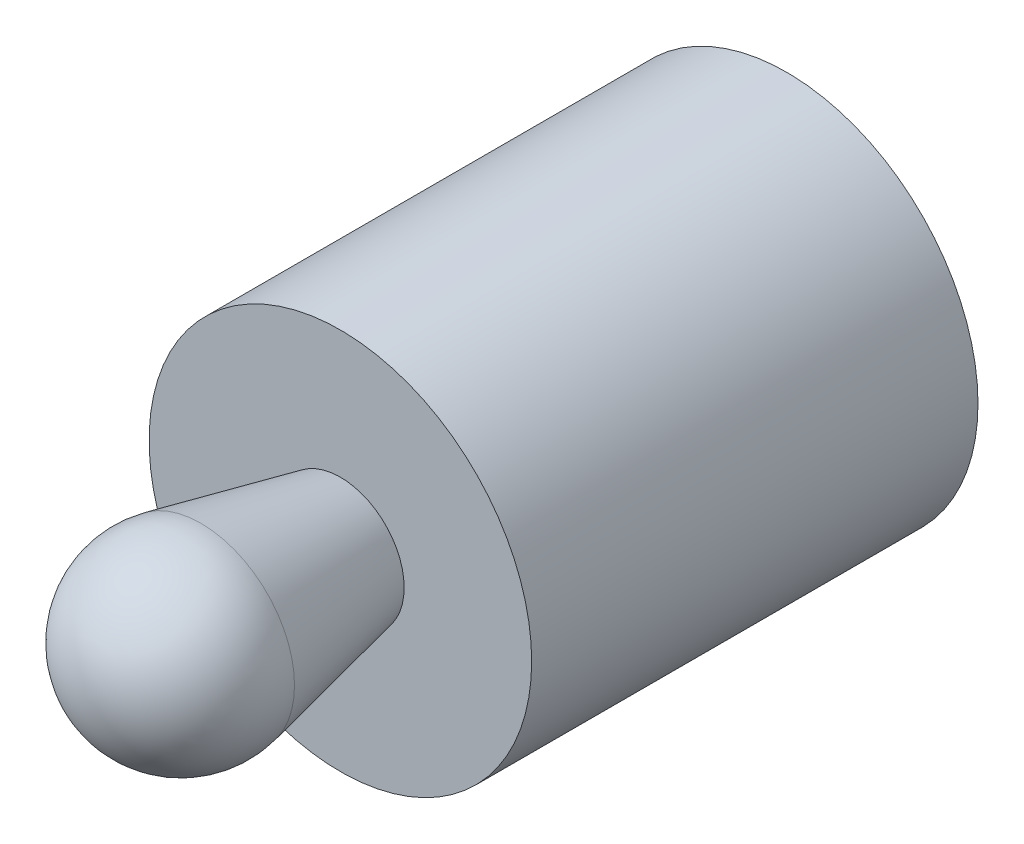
ISO-10303-21;
HEADER;
FILE_DESCRIPTION(('STEP AP214'),'2;1');
FILE_NAME('part.step','',(''),(''),'','','');
FILE_SCHEMA(('AUTOMOTIVE_DESIGN { 1 0 10303 214 1 1 1 1 }'));
ENDSEC;
DATA;
#1=APPLICATION_CONTEXT('core data for automotive mechanical design processes');
#2=APPLICATION_PROTOCOL_DEFINITION('international standard','automotive_design',2000,#1);
#3=PRODUCT_CONTEXT('',#1,'mechanical');
#4=PRODUCT('Part','Part','',(#3));
#5=PRODUCT_RELATED_PRODUCT_CATEGORY('part','',(#4));
#6=PRODUCT_DEFINITION_FORMATION('','',#4);
#7=PRODUCT_DEFINITION_CONTEXT('part definition',#1,'design');
#8=PRODUCT_DEFINITION('design','',#6,#7);
#9=PRODUCT_DEFINITION_SHAPE('','',#8);
#10=(LENGTH_UNIT() NAMED_UNIT(*) SI_UNIT(.MILLI.,.METRE.));
#11=(NAMED_UNIT(*) PLANE_ANGLE_UNIT() SI_UNIT($,.RADIAN.));
#12=(NAMED_UNIT(*) SI_UNIT($,.STERADIAN.) SOLID_ANGLE_UNIT());
#13=UNCERTAINTY_MEASURE_WITH_UNIT(LENGTH_MEASURE(1.E-05),#10,'distance_accuracy_value','');
#14=(GEOMETRIC_REPRESENTATION_CONTEXT(3) GLOBAL_UNCERTAINTY_ASSIGNED_CONTEXT((#13)) GLOBAL_UNIT_ASSIGNED_CONTEXT((#10,
#11,#12)) REPRESENTATION_CONTEXT('',''));
#15=CARTESIAN_POINT('',(0.,0.,0.));
#16=DIRECTION('',(0.,0.,1.));
#17=DIRECTION('',(1.,0.,0.));
#18=AXIS2_PLACEMENT_3D('',#15,#16,#17);
#19=CARTESIAN_POINT('',(0.,0.,0.));
#20=DIRECTION('',(0.,0.,1.));
#21=DIRECTION('',(1.,0.,0.));
#22=AXIS2_PLACEMENT_3D('',#19,#20,#21);
#23=PLANE('',#22);
#24=CARTESIAN_POINT('',(0.,0.,0.));
#25=DIRECTION('',(0.,0.,1.));
#26=DIRECTION('',(1.,0.,0.));
#27=AXIS2_PLACEMENT_3D('',#24,#25,#26);
#28=CIRCLE('',#27,3.);
#29=CARTESIAN_POINT('',(3.,0.,0.));
#30=VERTEX_POINT('',#29);
#31=EDGE_CURVE('E8',#30,#30,#28,.T.);
#32=ORIENTED_EDGE('',*,*,#31,.F.);
#33=EDGE_LOOP('',(#32));
#34=FACE_BOUND('',#33,.T.);
#35=ADVANCED_FACE('F12',(#34),#23,.F.);
#36=CARTESIAN_POINT('',(0.,0.,20.));
#37=DIRECTION('',(0.,0.,1.));
#38=DIRECTION('',(1.,0.,0.));
#39=AXIS2_PLACEMENT_3D('',#36,#37,#38);
#40=CYLINDRICAL_SURFACE('',#39,3.);
#41=CARTESIAN_POINT('',(0.,0.,7.));
#42=DIRECTION('',(0.,0.,1.));
#43=DIRECTION('',(1.,0.,0.));
#44=AXIS2_PLACEMENT_3D('',#41,#42,#43);
#45=CIRCLE('',#44,3.);
#46=CARTESIAN_POINT('',(3.,0.,7.));
#47=VERTEX_POINT('',#46);
#48=EDGE_CURVE('E18',#47,#47,#45,.T.);
#49=ORIENTED_EDGE('',*,*,#48,.F.);
#50=EDGE_LOOP('',(#49));
#51=FACE_BOUND('',#50,.T.);
#52=ORIENTED_EDGE('',*,*,#31,.T.);
#53=EDGE_LOOP('',(#52));
#54=FACE_BOUND('',#53,.T.);
#55=ADVANCED_FACE('F45',(#51,#54),#40,.T.);
#56=CARTESIAN_POINT('',(-1.,0.,7.));
#57=DIRECTION('',(0.,0.,1.));
#58=DIRECTION('',(1.,0.,0.));
#59=AXIS2_PLACEMENT_3D('',#56,#57,#58);
#60=PLANE('',#59);
#61=ORIENTED_EDGE('',*,*,#48,.T.);
#62=EDGE_LOOP('',(#61));
#63=FACE_BOUND('',#62,.T.);
#64=CARTESIAN_POINT('',(0.,0.,7.));
#65=DIRECTION('',(0.,0.,1.));
#66=DIRECTION('',(1.,0.,0.));
#67=AXIS2_PLACEMENT_3D('',#64,#65,#66);
#68=CIRCLE('',#67,1.);
#69=CARTESIAN_POINT('',(1.,0.,7.));
#70=VERTEX_POINT('',#69);
#71=EDGE_CURVE('E22',#70,#70,#68,.T.);
#72=ORIENTED_EDGE('',*,*,#71,.F.);
#73=EDGE_LOOP('',(#72));
#74=FACE_BOUND('',#73,.T.);
#75=ADVANCED_FACE('F36',(#63,#74),#60,.T.);
#76=CARTESIAN_POINT('',(0.,0.,9.18677268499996));
#77=DIRECTION('',(0.,0.,1.));
#78=DIRECTION('',(1.,0.,0.));
#79=AXIS2_PLACEMENT_3D('',#76,#77,#78);
#80=CONICAL_SURFACE('',#79,1.46693171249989,0.210366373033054);
#81=ORIENTED_EDGE('',*,*,#71,.T.);
#82=EDGE_LOOP('',(#81));
#83=FACE_BOUND('',#82,.T.);
#84=CARTESIAN_POINT('',(0.,0.,9.18677268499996));
#85=DIRECTION('',(0.,0.,1.));
#86=DIRECTION('',(1.,0.,0.));
#87=AXIS2_PLACEMENT_3D('',#84,#85,#86);
#88=CIRCLE('',#87,1.46693171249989);
#89=CARTESIAN_POINT('',(1.46693171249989,0.,9.18677268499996));
#90=VERTEX_POINT('',#89);
#91=EDGE_CURVE('E26',#90,#90,#88,.T.);
#92=ORIENTED_EDGE('',*,*,#91,.F.);
#93=EDGE_LOOP('',(#92));
#94=FACE_BOUND('',#93,.T.);
#95=ADVANCED_FACE('F34',(#83,#94),#80,.T.);
#96=CARTESIAN_POINT('',(0.,0.,9.5));
#97=DIRECTION('',(0.,0.,1.));
#98=DIRECTION('',(1.,0.,0.));
#99=AXIS2_PLACEMENT_3D('',#96,#97,#98);
#100=SPHERICAL_SURFACE('',#99,1.5);
#101=ORIENTED_EDGE('',*,*,#91,.T.);
#102=EDGE_LOOP('',(#101));
#103=FACE_BOUND('',#102,.T.);
#104=ADVANCED_FACE('F32',(#103),#100,.T.);
#105=CLOSED_SHELL('',(#35,#55,#75,#95,#104));
#106=MANIFOLD_SOLID_BREP('B1',#105);
#107=ADVANCED_BREP_SHAPE_REPRESENTATION('',(#18,#106),#14);
#108=SHAPE_DEFINITION_REPRESENTATION(#9,#107);
ENDSEC;
END-ISO-10303-21;
